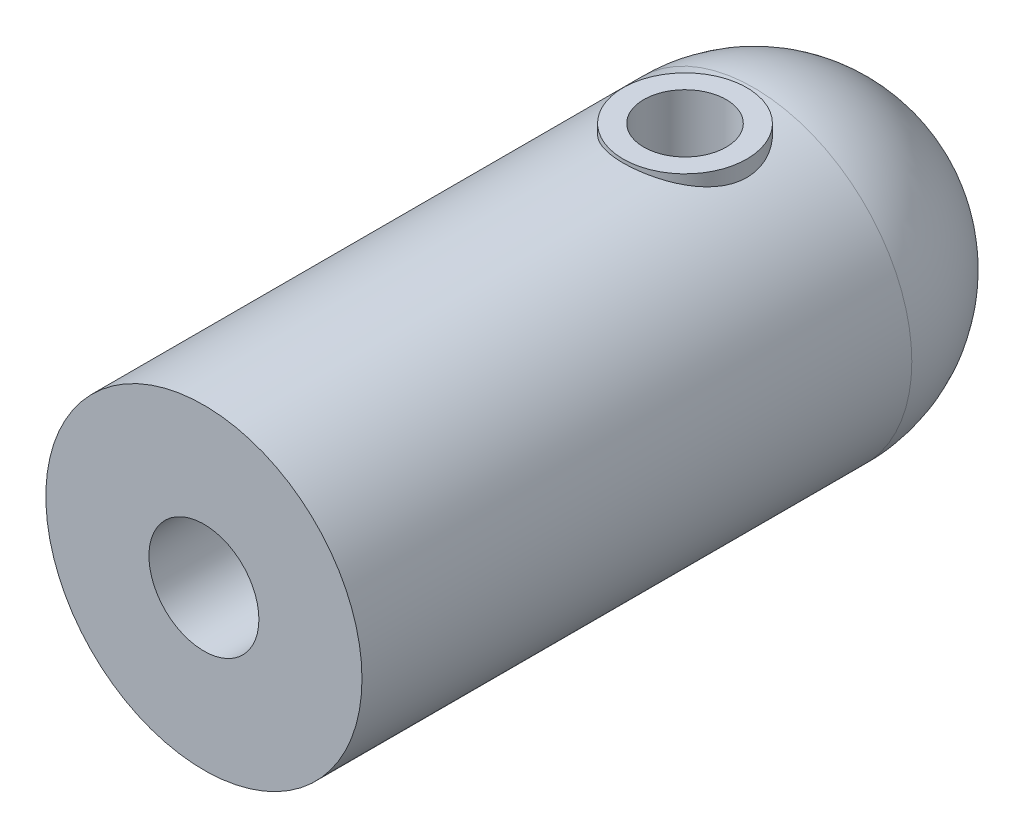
from build123d import *

# Parameters (mm, degrees)
ESQUISSE1_R             = 23
EXTRUSION1_DEPTH        = 80
ESQUISSE3_R             = 8
ENL_V_MAT_EXTRU_1_DEPTH = 90
EXTRUSION2_REACH        = 97.348
EXTRUSION2_END_RADIUS   = 23
ESQUISSE4_R             = 9
EXTRUSION3_REACH        = 97.593
EXTRUSION3_END_RADIUS   = 23
ESQUISSE5_R             = 9
ESQUISSE7_R             = 6
ENL_V_MAT_EXTRU_4_DEPTH = 10
ENL_V_START             = -10
ESQUISSE8_R             = 6
ENL_V_MAT_EXTRU_5_DEPTH = 10


with BuildPart() as part:
    # Esquisse1 → Extrusion1 (new body)
    with BuildSketch(Plane.XY):
        Circle(ESQUISSE1_R)
    extrude(amount=EXTRUSION1_DEPTH)

    # Esquisse3 → Enl_v. mat.-Extru.1 (cut)
    with BuildSketch(Plane.XY.offset(80)):
        Circle(ESQUISSE3_R)
    extrude(amount=-ENL_V_MAT_EXTRU_1_DEPTH, mode=Mode.SUBTRACT)

    # Extrusion2: up to this cylinder (the profile starts outside it)
    extrusion2_end = Plane(origin=(0, 0, 10), z_dir=(0, 0, -1)) * Cylinder(EXTRUSION2_END_RADIUS, 241.696, mode=Mode.PRIVATE)
    # Esquisse4 → Extrusion2 (add, up to the surface)
    with BuildSketch(Plane(origin=(0, 23.5, 0), x_dir=(-1, 0, 0), z_dir=(0, 1, 0)), mode=Mode.PRIVATE) as extrusion2_sk1:
        with Locations(Location((0, 10, 0), (0, 0, 90))):
            Circle(ESQUISSE4_R)
    extrusion2_tool1 = extrude(extrusion2_sk1.sketch, amount=-EXTRUSION2_REACH, mode=Mode.PRIVATE) - extrusion2_end
    add(extrusion2_tool1.solids().sort_by_distance((0, 23.5, 10))[0])

    # Extrusion3: up to this cylinder (the profile starts outside it)
    extrusion3_end = Plane(origin=(0, 0, 10), z_dir=(0, 0, -1)) * Cylinder(EXTRUSION3_END_RADIUS, 242.186, mode=Mode.PRIVATE)
    # Esquisse5 → Extrusion3 (add, up to the surface)
    with BuildSketch(Plane(origin=(0, -23.5, 0), x_dir=(-1, 0, 0), z_dir=(0, 1, 0)), mode=Mode.PRIVATE) as extrusion3_sk1:
        with Locations(Location((0, 10, 0), (0, 0, 90))):
            Circle(ESQUISSE5_R)
    extrusion3_tool1 = extrude(extrusion3_sk1.sketch, amount=EXTRUSION3_REACH, mode=Mode.PRIVATE) - extrusion3_end
    add(extrusion3_tool1.solids().sort_by_distance((0, -23.5, 10))[0])

    # Esquisse7 → Enl_v. mat.-Extru.4 (cut)
    with BuildSketch(Plane.XZ.offset(23.5)):
        with Locations(Location((0, 10, 0), (0, 0, 270))):
            Circle(ESQUISSE7_R)
    extrude(amount=-ENL_V_MAT_EXTRU_4_DEPTH, mode=Mode.SUBTRACT)

    # Esquisse8 → Enl_v. mat.-Extru.5 (cut)
    with BuildSketch(Plane(origin=(0, 23.5, 0), x_dir=(-1, 0, 0), z_dir=(0, 1, 0)).offset(ENL_V_START)):
        with Locations(Location((0, 10, 0), (0, 0, 270))):
            Circle(ESQUISSE8_R)
    extrude(amount=ENL_V_MAT_EXTRU_5_DEPTH, mode=Mode.SUBTRACT)

    # Esquisse9 → R_volution2 (revolve)
    with BuildSketch(Plane(origin=(0, 0, 0), x_dir=(1, 0, 0), z_dir=(0, 1, 0))):
        with BuildLine():
            Line((-23, 0), (0, 0))
            Line((0, 0), (0, 23.16972973))
            ThreePointArc((0, 23.16972973), (-16.298608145, 16.348320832), (-23, 0))
        make_face()
    revolve(axis=Axis((0, 0, 0), (0, 0, -1)))


solid = part.part
